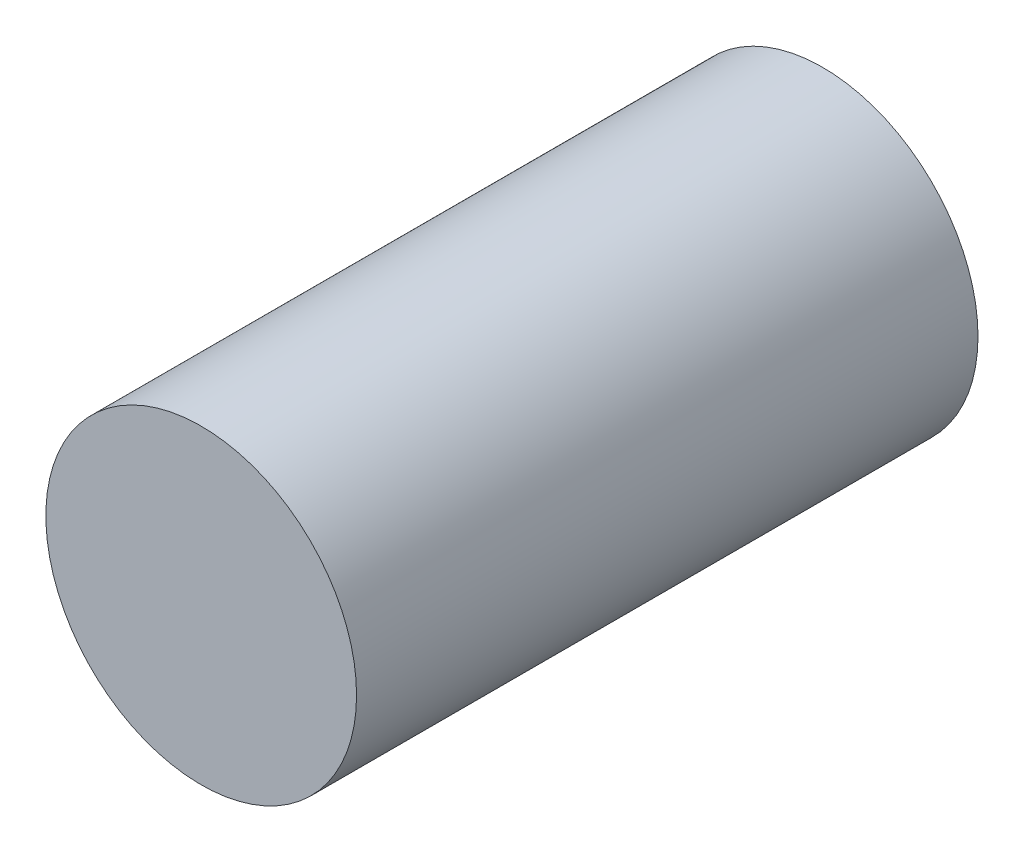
from build123d import *

# Parameters (mm, degrees)
IZIM1_R                     = 4
Y_KSEKLIK_EKSTR_ZYON1_DEPTH = 16


with BuildPart() as part:
    # izim1 → Y_kseklik-Ekstr_zyon1 (new body)
    with BuildSketch(Plane.XY):
        Circle(IZIM1_R)
    extrude(amount=Y_KSEKLIK_EKSTR_ZYON1_DEPTH)


solid = part.part
